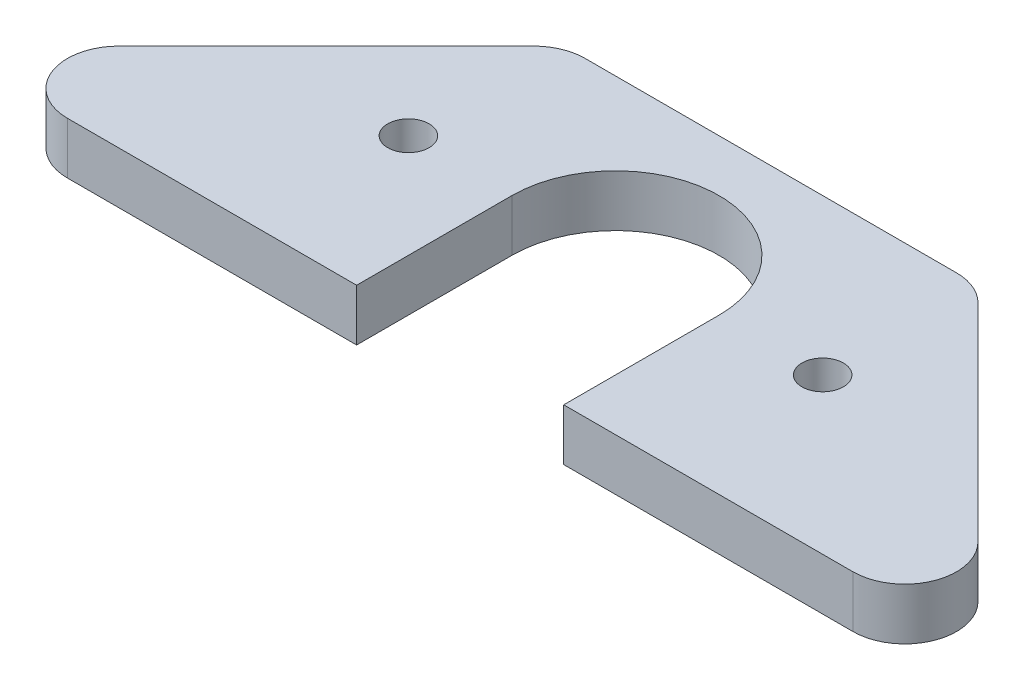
from build123d import *

# Parameters (mm, degrees)
SKETCH1_R           = 2
BOSS_EXTRUDE1_DEPTH = 5
FILLET1_R           = 5


with BuildPart() as part:
    # Sketch1 → Boss-Extrude1 (new body)
    with BuildSketch(Plane(origin=(0, 0, 0), x_dir=(1, 0, 0), z_dir=(0, 1, 0))):
        with BuildLine():
            Line((-10, 0), (-10, -15))
            Line((-10, -15), (-50, -15))
            Line((-50, -15), (-20, 15))
            Line((-20, 15), (20, 15))
            Line((20, 15), (50, -15))
            Line((50, -15), (10, -15))
            Line((10, -15), (10, 0))
            ThreePointArc((10, 0), (0, 10), (-10, 0))
        make_face()
        with Locations(Location((-20, 0, 0), (0, 0, 270))):
            Circle(SKETCH1_R, mode=Mode.SUBTRACT)
        with Locations(Location((20, 0, 0), (0, 0, 90))):
            Circle(SKETCH1_R, mode=Mode.SUBTRACT)
    extrude(amount=BOSS_EXTRUDE1_DEPTH)

    # Fillet1
    fillet1_edges = [part.edges().sort_by_distance(p)[0] for p in [
        (-50, 2.5, 15),
        (-20, 2.5, -15),
        (20, 2.5, -15),
        (50, 2.5, 15),
    ]]
    fillet(fillet1_edges, radius=FILLET1_R)


solid = part.part
